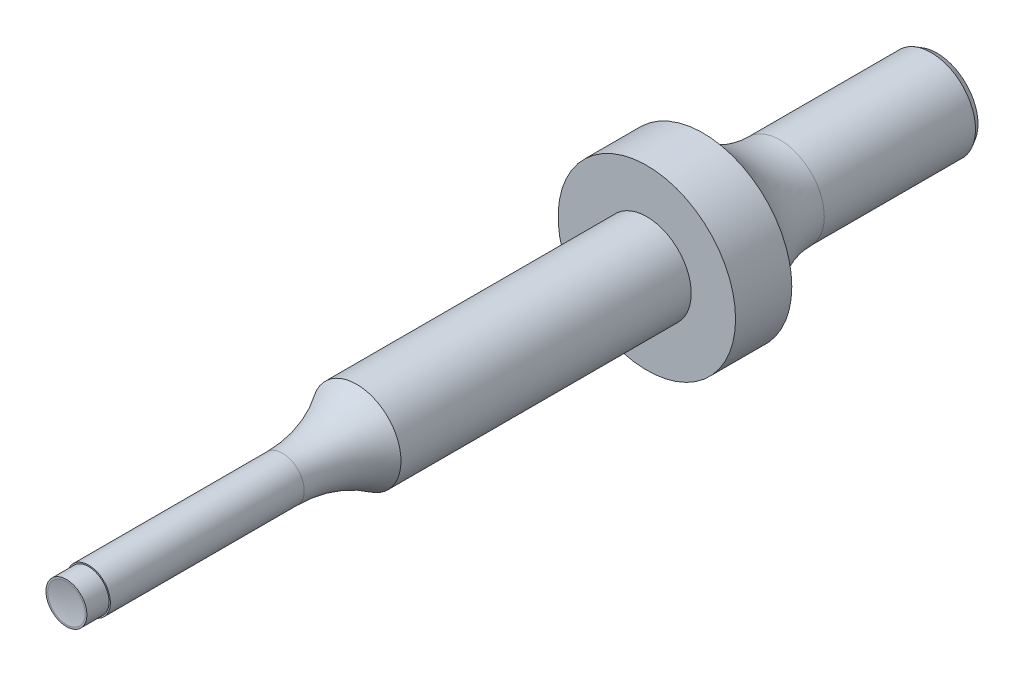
ISO-10303-21;
HEADER;
FILE_DESCRIPTION(('STEP AP214'),'2;1');
FILE_NAME('part.step','',(''),(''),'','','');
FILE_SCHEMA(('AUTOMOTIVE_DESIGN { 1 0 10303 214 1 1 1 1 }'));
ENDSEC;
DATA;
#1=APPLICATION_CONTEXT('core data for automotive mechanical design processes');
#2=APPLICATION_PROTOCOL_DEFINITION('international standard','automotive_design',2000,#1);
#3=PRODUCT_CONTEXT('',#1,'mechanical');
#4=PRODUCT('Part','Part','',(#3));
#5=PRODUCT_RELATED_PRODUCT_CATEGORY('part','',(#4));
#6=PRODUCT_DEFINITION_FORMATION('','',#4);
#7=PRODUCT_DEFINITION_CONTEXT('part definition',#1,'design');
#8=PRODUCT_DEFINITION('design','',#6,#7);
#9=PRODUCT_DEFINITION_SHAPE('','',#8);
#10=(LENGTH_UNIT() NAMED_UNIT(*) SI_UNIT(.MILLI.,.METRE.));
#11=(NAMED_UNIT(*) PLANE_ANGLE_UNIT() SI_UNIT($,.RADIAN.));
#12=(NAMED_UNIT(*) SI_UNIT($,.STERADIAN.) SOLID_ANGLE_UNIT());
#13=UNCERTAINTY_MEASURE_WITH_UNIT(LENGTH_MEASURE(1.E-05),#10,'distance_accuracy_value','');
#14=(GEOMETRIC_REPRESENTATION_CONTEXT(3) GLOBAL_UNCERTAINTY_ASSIGNED_CONTEXT((#13)) GLOBAL_UNIT_ASSIGNED_CONTEXT((#10,
#11,#12)) REPRESENTATION_CONTEXT('',''));
#15=CARTESIAN_POINT('',(0.,0.,0.));
#16=DIRECTION('',(0.,0.,1.));
#17=DIRECTION('',(1.,0.,0.));
#18=AXIS2_PLACEMENT_3D('',#15,#16,#17);
#19=CARTESIAN_POINT('',(0.,0.,-100.));
#20=DIRECTION('',(0.,0.,1.));
#21=DIRECTION('',(1.,0.,0.));
#22=AXIS2_PLACEMENT_3D('',#19,#20,#21);
#23=CYLINDRICAL_SURFACE('',#22,5.095);
#24=CARTESIAN_POINT('',(0.,0.,-33.3333333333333));
#25=DIRECTION('',(0.,0.,-1.));
#26=DIRECTION('',(0.,1.,0.));
#27=AXIS2_PLACEMENT_3D('',#24,#25,#26);
#28=CIRCLE('',#27,5.095);
#29=CARTESIAN_POINT('',(0.,5.095,-33.3333333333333));
#30=VERTEX_POINT('',#29);
#31=EDGE_CURVE('E77',#30,#30,#28,.T.);
#32=ORIENTED_EDGE('',*,*,#31,.T.);
#33=EDGE_LOOP('',(#32));
#34=FACE_BOUND('',#33,.T.);
#35=CARTESIAN_POINT('',(0.,0.,-66.6666666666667));
#36=DIRECTION('',(0.,0.,-1.));
#37=DIRECTION('',(-1.,0.,0.));
#38=AXIS2_PLACEMENT_3D('',#35,#36,#37);
#39=CIRCLE('',#38,5.095);
#40=CARTESIAN_POINT('',(-5.095,0.,-66.6666666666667));
#41=VERTEX_POINT('',#40);
#42=EDGE_CURVE('E44',#41,#41,#39,.F.);
#43=ORIENTED_EDGE('',*,*,#42,.T.);
#44=EDGE_LOOP('',(#43));
#45=FACE_BOUND('',#44,.T.);
#46=ADVANCED_FACE('F40',(#34,#45),#23,.T.);
#47=CARTESIAN_POINT('',(0.,0.,-33.3333333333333));
#48=DIRECTION('',(0.,0.,1.));
#49=DIRECTION('',(1.,0.,0.));
#50=AXIS2_PLACEMENT_3D('',#47,#48,#49);
#51=CYLINDRICAL_SURFACE('',#50,2.5);
#52=CARTESIAN_POINT('',(0.,0.,-24.8130560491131));
#53=DIRECTION('',(0.,0.,1.));
#54=DIRECTION('',(0.,-1.,0.));
#55=AXIS2_PLACEMENT_3D('',#52,#53,#54);
#56=CIRCLE('',#55,2.5);
#57=CARTESIAN_POINT('',(0.,-2.5,-24.8130560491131));
#58=VERTEX_POINT('',#57);
#59=EDGE_CURVE('E12',#58,#58,#56,.F.);
#60=ORIENTED_EDGE('',*,*,#59,.F.);
#61=EDGE_LOOP('',(#60));
#62=FACE_BOUND('',#61,.T.);
#63=CARTESIAN_POINT('',(0.,0.,-2.5475));
#64=DIRECTION('',(0.,0.,1.));
#65=DIRECTION('',(1.,0.,0.));
#66=AXIS2_PLACEMENT_3D('',#63,#64,#65);
#67=CIRCLE('',#66,2.5);
#68=CARTESIAN_POINT('',(2.5,0.,-2.5475));
#69=VERTEX_POINT('',#68);
#70=EDGE_CURVE('E62',#69,#69,#67,.F.);
#71=ORIENTED_EDGE('',*,*,#70,.T.);
#72=EDGE_LOOP('',(#71));
#73=FACE_BOUND('',#72,.T.);
#74=ADVANCED_FACE('F106',(#62,#73),#51,.T.);
#75=CARTESIAN_POINT('',(0.,0.,-2.5475));
#76=DIRECTION('',(0.,0.,1.));
#77=DIRECTION('',(1.,0.,0.));
#78=AXIS2_PLACEMENT_3D('',#75,#76,#77);
#79=PLANE('',#78);
#80=ORIENTED_EDGE('',*,*,#70,.F.);
#81=EDGE_LOOP('',(#80));
#82=FACE_BOUND('',#81,.T.);
#83=CARTESIAN_POINT('',(0.,0.,-2.5475));
#84=DIRECTION('',(0.,0.,1.));
#85=DIRECTION('',(1.,0.,0.));
#86=AXIS2_PLACEMENT_3D('',#83,#84,#85);
#87=CIRCLE('',#86,2.35);
#88=CARTESIAN_POINT('',(2.35,0.,-2.5475));
#89=VERTEX_POINT('',#88);
#90=EDGE_CURVE('E66',#89,#89,#87,.T.);
#91=ORIENTED_EDGE('',*,*,#90,.F.);
#92=EDGE_LOOP('',(#91));
#93=FACE_BOUND('',#92,.T.);
#94=ADVANCED_FACE('F111',(#82,#93),#79,.T.);
#95=CARTESIAN_POINT('',(0.,0.,-2.5475));
#96=DIRECTION('',(0.,0.,1.));
#97=DIRECTION('',(1.,0.,0.));
#98=AXIS2_PLACEMENT_3D('',#95,#96,#97);
#99=CYLINDRICAL_SURFACE('',#98,2.35);
#100=CARTESIAN_POINT('',(0.,0.,0.));
#101=DIRECTION('',(0.,0.,1.));
#102=DIRECTION('',(1.,0.,0.));
#103=AXIS2_PLACEMENT_3D('',#100,#101,#102);
#104=CIRCLE('',#103,2.35);
#105=CARTESIAN_POINT('',(2.35,0.,0.));
#106=VERTEX_POINT('',#105);
#107=EDGE_CURVE('E67',#106,#106,#104,.T.);
#108=CARTESIAN_POINT('',(2.35,0.,-2.5475));
#109=CARTESIAN_POINT('',(2.35,0.,-2.52096354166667));
#110=CARTESIAN_POINT('',(2.35,0.,-2.49442708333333));
#111=CARTESIAN_POINT('',(2.35,0.,-2.44135416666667));
#112=CARTESIAN_POINT('',(2.35,0.,-2.41481770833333));
#113=CARTESIAN_POINT('',(2.35,0.,-2.36174479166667));
#114=CARTESIAN_POINT('',(2.35,0.,-2.33520833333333));
#115=CARTESIAN_POINT('',(2.35,0.,-2.28213541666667));
#116=CARTESIAN_POINT('',(2.35,0.,-2.25559895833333));
#117=CARTESIAN_POINT('',(2.35,0.,-2.20252604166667));
#118=CARTESIAN_POINT('',(2.35,0.,-2.17598958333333));
#119=CARTESIAN_POINT('',(2.35,0.,-2.12291666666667));
#120=CARTESIAN_POINT('',(2.35,0.,-2.09638020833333));
#121=CARTESIAN_POINT('',(2.35,0.,-2.04330729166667));
#122=CARTESIAN_POINT('',(2.35,0.,-2.01677083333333));
#123=CARTESIAN_POINT('',(2.35,0.,-1.96369791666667));
#124=CARTESIAN_POINT('',(2.35,0.,-1.93716145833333));
#125=CARTESIAN_POINT('',(2.35,0.,-1.88408854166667));
#126=CARTESIAN_POINT('',(2.35,0.,-1.85755208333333));
#127=CARTESIAN_POINT('',(2.35,0.,-1.80447916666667));
#128=CARTESIAN_POINT('',(2.35,0.,-1.77794270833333));
#129=CARTESIAN_POINT('',(2.35,0.,-1.72486979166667));
#130=CARTESIAN_POINT('',(2.35,0.,-1.69833333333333));
#131=CARTESIAN_POINT('',(2.35,0.,-1.64526041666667));
#132=CARTESIAN_POINT('',(2.35,0.,-1.61872395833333));
#133=CARTESIAN_POINT('',(2.35,0.,-1.56565104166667));
#134=CARTESIAN_POINT('',(2.35,0.,-1.53911458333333));
#135=CARTESIAN_POINT('',(2.35,0.,-1.48604166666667));
#136=CARTESIAN_POINT('',(2.35,0.,-1.45950520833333));
#137=CARTESIAN_POINT('',(2.35,0.,-1.40643229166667));
#138=CARTESIAN_POINT('',(2.35,0.,-1.37989583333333));
#139=CARTESIAN_POINT('',(2.35,0.,-1.32682291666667));
#140=CARTESIAN_POINT('',(2.35,0.,-1.30028645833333));
#141=CARTESIAN_POINT('',(2.35,0.,-1.24721354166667));
#142=CARTESIAN_POINT('',(2.35,0.,-1.22067708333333));
#143=CARTESIAN_POINT('',(2.35,0.,-1.16760416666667));
#144=CARTESIAN_POINT('',(2.35,0.,-1.14106770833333));
#145=CARTESIAN_POINT('',(2.35,0.,-1.08799479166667));
#146=CARTESIAN_POINT('',(2.35,0.,-1.06145833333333));
#147=CARTESIAN_POINT('',(2.35,0.,-1.00838541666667));
#148=CARTESIAN_POINT('',(2.35,0.,-0.981848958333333));
#149=CARTESIAN_POINT('',(2.35,0.,-0.928776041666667));
#150=CARTESIAN_POINT('',(2.35,0.,-0.902239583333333));
#151=CARTESIAN_POINT('',(2.35,0.,-0.849166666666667));
#152=CARTESIAN_POINT('',(2.35,0.,-0.822630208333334));
#153=CARTESIAN_POINT('',(2.35,0.,-0.769557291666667));
#154=CARTESIAN_POINT('',(2.35,0.,-0.743020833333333));
#155=CARTESIAN_POINT('',(2.35,0.,-0.689947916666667));
#156=CARTESIAN_POINT('',(2.35,0.,-0.663411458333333));
#157=CARTESIAN_POINT('',(2.35,0.,-0.610338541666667));
#158=CARTESIAN_POINT('',(2.35,0.,-0.583802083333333));
#159=CARTESIAN_POINT('',(2.35,0.,-0.530729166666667));
#160=CARTESIAN_POINT('',(2.35,0.,-0.504192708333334));
#161=CARTESIAN_POINT('',(2.35,0.,-0.451119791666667));
#162=CARTESIAN_POINT('',(2.35,0.,-0.424583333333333));
#163=CARTESIAN_POINT('',(2.35,0.,-0.371510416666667));
#164=CARTESIAN_POINT('',(2.35,0.,-0.344973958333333));
#165=CARTESIAN_POINT('',(2.35,0.,-0.291901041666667));
#166=CARTESIAN_POINT('',(2.35,0.,-0.265364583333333));
#167=CARTESIAN_POINT('',(2.35,0.,-0.212291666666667));
#168=CARTESIAN_POINT('',(2.35,0.,-0.185755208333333));
#169=CARTESIAN_POINT('',(2.35,0.,-0.132682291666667));
#170=CARTESIAN_POINT('',(2.35,0.,-0.106145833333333));
#171=CARTESIAN_POINT('',(2.35,0.,-0.0530729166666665));
#172=CARTESIAN_POINT('',(2.35,0.,-0.0265364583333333));
#173=CARTESIAN_POINT('',(2.35,0.,0.));
#174=B_SPLINE_CURVE_WITH_KNOTS('',3,(#108,#109,#110,#111,#112,#113,#114,#115,#116,#117,#118,
#119,#120,#121,#122,#123,#124,#125,#126,#127,#128,#129,#130,#131,#132,#133,#134,#135,#136,#137,
#138,#139,#140,#141,#142,#143,#144,#145,#146,#147,#148,#149,#150,#151,#152,#153,#154,#155,#156,
#157,#158,#159,#160,#161,#162,#163,#164,#165,#166,#167,#168,#169,#170,#171,#172,#173),
.UNSPECIFIED.,.F.,.F.,(4,2,2,2,2,2,2,2,2,2,2,2,2,2,2,2,2,2,2,2,2,2,2,2,2,2,2,2,2,2,2,2,4),(0.,
0.0796093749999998,0.15921875,0.238828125,0.3184375,0.398046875,0.47765625,0.557265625,0.636875,
0.716484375,0.79609375,0.875703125,0.9553125,1.034921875,1.11453125,1.194140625,1.27375,
1.353359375,1.43296875,1.512578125,1.5921875,1.671796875,1.75140625,1.831015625,1.910625,
1.990234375,2.06984375,2.149453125,2.2290625,2.308671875,2.38828125,2.467890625,2.5475),.UNSPECIFIED.);
#175=EDGE_CURVE('BSEAM147',#89,#106,#174,.T.);
#176=ORIENTED_EDGE('',*,*,#90,.T.);
#177=ORIENTED_EDGE('',*,*,#107,.F.);
#178=ORIENTED_EDGE('',*,*,#175,.T.);
#179=ORIENTED_EDGE('',*,*,#175,.F.);
#180=EDGE_LOOP('',(#176,#178,#177,#179));
#181=FACE_BOUND('',#180,.T.);
#182=ADVANCED_FACE('F147',(#181),#99,.T.);
#183=CARTESIAN_POINT('',(0.,0.,0.));
#184=DIRECTION('',(0.,0.,1.));
#185=DIRECTION('',(1.,0.,0.));
#186=AXIS2_PLACEMENT_3D('',#183,#184,#185);
#187=PLANE('',#186);
#188=CARTESIAN_POINT('',(0.,0.,0.));
#189=DIRECTION('',(0.,0.,1.));
#190=DIRECTION('',(0.,-1.,0.));
#191=AXIS2_PLACEMENT_3D('',#188,#189,#190);
#192=CIRCLE('',#191,2.15);
#193=CARTESIAN_POINT('',(0.,-2.15,0.));
#194=VERTEX_POINT('',#193);
#195=EDGE_CURVE('E71',#194,#194,#192,.T.);
#196=ORIENTED_EDGE('',*,*,#195,.F.);
#197=EDGE_LOOP('',(#196));
#198=FACE_BOUND('',#197,.T.);
#199=ORIENTED_EDGE('',*,*,#107,.T.);
#200=EDGE_LOOP('',(#199));
#201=FACE_BOUND('',#200,.T.);
#202=ADVANCED_FACE('F145',(#198,#201),#187,.T.);
#203=CARTESIAN_POINT('',(0.,0.,9.96060239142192));
#204=DIRECTION('',(0.,0.,1.));
#205=DIRECTION('',(0.,1.,0.));
#206=AXIS2_PLACEMENT_3D('',#203,#204,#205);
#207=SPHERICAL_SURFACE('',#206,10.19);
#208=ORIENTED_EDGE('',*,*,#195,.T.);
#209=EDGE_LOOP('',(#208));
#210=FACE_BOUND('',#209,.T.);
#211=ADVANCED_FACE('F142',(#210),#207,.F.);
#212=CARTESIAN_POINT('',(0.,0.,-24.8130560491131));
#213=DIRECTION('',(0.,0.,-1.));
#214=DIRECTION('',(0.,1.,0.));
#215=AXIS2_PLACEMENT_3D('',#212,#213,#214);
#216=TOROIDAL_SURFACE('',#215,17.785,15.285);
#217=ORIENTED_EDGE('',*,*,#59,.T.);
#218=EDGE_LOOP('',(#217));
#219=FACE_BOUND('',#218,.T.);
#220=ORIENTED_EDGE('',*,*,#31,.F.);
#221=EDGE_LOOP('',(#220));
#222=FACE_BOUND('',#221,.T.);
#223=ADVANCED_FACE('F123',(#219,#222),#216,.F.);
#224=CARTESIAN_POINT('',(0.,0.,-66.6666666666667));
#225=DIRECTION('',(0.,0.,-1.));
#226=DIRECTION('',(-1.,0.,0.));
#227=AXIS2_PLACEMENT_3D('',#224,#225,#226);
#228=PLANE('',#227);
#229=ORIENTED_EDGE('',*,*,#42,.F.);
#230=EDGE_LOOP('',(#229));
#231=FACE_BOUND('',#230,.T.);
#232=CARTESIAN_POINT('',(0.,0.,-66.6666666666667));
#233=DIRECTION('',(0.,0.,1.));
#234=DIRECTION('',(1.,0.,0.));
#235=AXIS2_PLACEMENT_3D('',#232,#233,#234);
#236=CIRCLE('',#235,10.19);
#237=CARTESIAN_POINT('',(10.19,0.,-66.6666666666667));
#238=VERTEX_POINT('',#237);
#239=EDGE_CURVE('E81',#238,#238,#236,.T.);
#240=ORIENTED_EDGE('',*,*,#239,.T.);
#241=EDGE_LOOP('',(#240));
#242=FACE_BOUND('',#241,.T.);
#243=ADVANCED_FACE('F119',(#231,#242),#228,.F.);
#244=CARTESIAN_POINT('',(0.,0.,-66.6666666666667));
#245=DIRECTION('',(0.,0.,1.));
#246=DIRECTION('',(1.,0.,0.));
#247=AXIS2_PLACEMENT_3D('',#244,#245,#246);
#248=CYLINDRICAL_SURFACE('',#247,10.19);
#249=ORIENTED_EDGE('',*,*,#239,.F.);
#250=EDGE_LOOP('',(#249));
#251=FACE_BOUND('',#250,.T.);
#252=CARTESIAN_POINT('',(0.,0.,-73.1268678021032));
#253=DIRECTION('',(0.,0.,1.));
#254=DIRECTION('',(1.,0.,0.));
#255=AXIS2_PLACEMENT_3D('',#252,#253,#254);
#256=CIRCLE('',#255,10.19);
#257=CARTESIAN_POINT('',(10.19,0.,-73.1268678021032));
#258=VERTEX_POINT('',#257);
#259=EDGE_CURVE('E85',#258,#258,#256,.T.);
#260=ORIENTED_EDGE('',*,*,#259,.T.);
#261=EDGE_LOOP('',(#260));
#262=FACE_BOUND('',#261,.T.);
#263=ADVANCED_FACE('F122',(#251,#262),#248,.T.);
#264=CARTESIAN_POINT('',(0.,0.,-81.9516666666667));
#265=DIRECTION('',(0.,0.,1.));
#266=DIRECTION('',(1.,0.,0.));
#267=AXIS2_PLACEMENT_3D('',#264,#265,#266);
#268=TOROIDAL_SURFACE('',#267,15.285,10.19);
#269=ORIENTED_EDGE('',*,*,#259,.F.);
#270=EDGE_LOOP('',(#269));
#271=FACE_BOUND('',#270,.T.);
#272=CARTESIAN_POINT('',(0.,0.,-81.9516666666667));
#273=DIRECTION('',(0.,0.,1.));
#274=DIRECTION('',(1.,0.,0.));
#275=AXIS2_PLACEMENT_3D('',#272,#273,#274);
#276=CIRCLE('',#275,5.095);
#277=CARTESIAN_POINT('',(5.095,0.,-81.9516666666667));
#278=VERTEX_POINT('',#277);
#279=EDGE_CURVE('E89',#278,#278,#276,.T.);
#280=ORIENTED_EDGE('',*,*,#279,.T.);
#281=EDGE_LOOP('',(#280));
#282=FACE_BOUND('',#281,.T.);
#283=ADVANCED_FACE('F94',(#271,#282),#268,.F.);
#284=CARTESIAN_POINT('',(0.,0.,-100.));
#285=DIRECTION('',(0.,0.,1.));
#286=DIRECTION('',(1.,0.,0.));
#287=AXIS2_PLACEMENT_3D('',#284,#285,#286);
#288=PLANE('',#287);
#289=CARTESIAN_POINT('',(0.,0.,-100.));
#290=DIRECTION('',(0.,0.,1.));
#291=DIRECTION('',(1.,0.,0.));
#292=AXIS2_PLACEMENT_3D('',#289,#290,#291);
#293=CIRCLE('',#292,4.70278671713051);
#294=CARTESIAN_POINT('',(4.70278671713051,0.,-100.));
#295=VERTEX_POINT('',#294);
#296=EDGE_CURVE('E49',#295,#295,#293,.F.);
#297=ORIENTED_EDGE('',*,*,#296,.T.);
#298=EDGE_LOOP('',(#297));
#299=FACE_BOUND('',#298,.T.);
#300=ADVANCED_FACE('F102',(#299),#288,.F.);
#301=CARTESIAN_POINT('',(0.,0.,-99.3206666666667));
#302=DIRECTION('',(0.,0.,1.));
#303=DIRECTION('',(1.,0.,0.));
#304=AXIS2_PLACEMENT_3D('',#301,#302,#303);
#305=CONICAL_SURFACE('',#304,5.095,0.523598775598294);
#306=ORIENTED_EDGE('',*,*,#296,.F.);
#307=EDGE_LOOP('',(#306));
#308=FACE_BOUND('',#307,.T.);
#309=CARTESIAN_POINT('',(0.,0.,-99.3206666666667));
#310=DIRECTION('',(0.,0.,1.));
#311=DIRECTION('',(1.,0.,0.));
#312=AXIS2_PLACEMENT_3D('',#309,#310,#311);
#313=CIRCLE('',#312,5.095);
#314=CARTESIAN_POINT('',(5.095,0.,-99.3206666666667));
#315=VERTEX_POINT('',#314);
#316=EDGE_CURVE('E56',#315,#315,#313,.T.);
#317=ORIENTED_EDGE('',*,*,#316,.F.);
#318=EDGE_LOOP('',(#317));
#319=FACE_BOUND('',#318,.T.);
#320=ADVANCED_FACE('F42',(#308,#319),#305,.T.);
#321=ORIENTED_EDGE('',*,*,#316,.T.);
#322=EDGE_LOOP('',(#321));
#323=FACE_BOUND('',#322,.T.);
#324=ORIENTED_EDGE('',*,*,#279,.F.);
#325=EDGE_LOOP('',(#324));
#326=FACE_BOUND('',#325,.T.);
#327=ADVANCED_FACE('F96',(#323,#326),#23,.T.);
#328=CLOSED_SHELL('',(#46,#74,#94,#182,#202,#211,#223,#243,#263,#283,#300,#320,#327));
#329=MANIFOLD_SOLID_BREP('B2',#328);
#330=ADVANCED_BREP_SHAPE_REPRESENTATION('',(#18,#329),#14);
#331=SHAPE_DEFINITION_REPRESENTATION(#9,#330);
ENDSEC;
END-ISO-10303-21;
